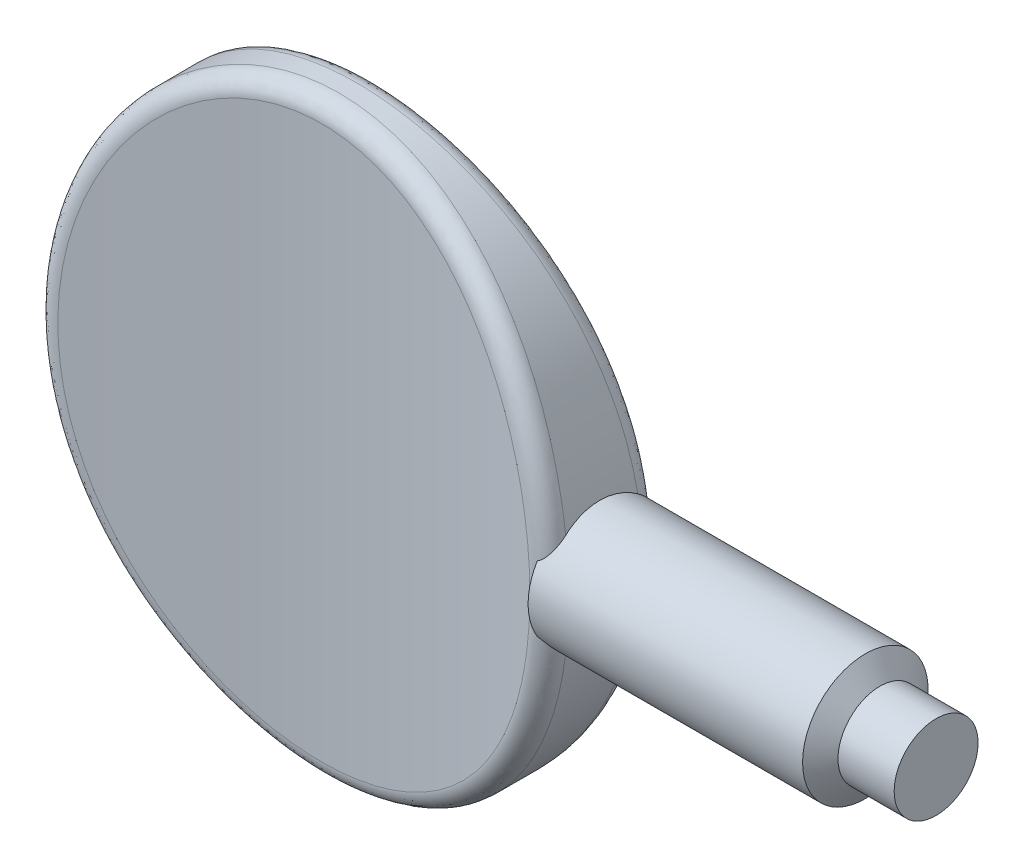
from build123d import *

# Parameters (mm, degrees)
SKETCH1_RX              = 11.303
SKETCH1_RY              = 9.906
EXTRUDE1_DEPTH          = 2.286
CUT_EXTRUDE1_DEPTH      = 16.202382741
CUT_EXTRUDE1_DEPTH_BACK = 16.202382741
SKETCH2_OUTSIDE_W       = 27.892
SKETCH2_OUTSIDE_H       = 12.652
FILLET3_R               = 0.677333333


with BuildPart() as part:
    # Sketch1 → Extrude1 (new, symmetric)
    with BuildSketch(Plane.XY):
        with Locations(Location((0, 0), (0, 0, -90))):
            Ellipse(SKETCH1_RX, SKETCH1_RY)
    extrude(amount=EXTRUDE1_DEPTH, both=True)

    # Sketch2 outside → Cut-Extrude1 (cut, two sides: drawn at the far end of the back side and taken through both)
    with BuildSketch(Plane(origin=(0, 0, 0), x_dir=(1, 0, 0), z_dir=(0, 1, 0)).offset(-CUT_EXTRUDE1_DEPTH_BACK)):
        Rectangle(SKETCH2_OUTSIDE_W, SKETCH2_OUTSIDE_H)
        with BuildLine():
            Line((-9.906, 2.286), (-9.906, -2.286))
            ThreePointArc((-9.906, -2.286), (0, -1.016), (9.906, -2.286))
            Line((9.906, -2.286), (9.906, 2.286))
            ThreePointArc((9.906, 2.286), (0, 1.016), (-9.906, 2.286))
        make_face(mode=Mode.SUBTRACT)
    extrude(amount=CUT_EXTRUDE1_DEPTH + CUT_EXTRUDE1_DEPTH_BACK, mode=Mode.SUBTRACT)

    # Fillet3
    fillet3_edges = [part.edges().sort_by_distance(p)[0] for p in [
        (-7.228513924, -7.728494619, 1.687044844),
        (3.75e-07, 11.303, -1.016),
    ]]
    fillet(fillet3_edges, radius=FILLET3_R)

    # Sketch3 → Revolve1 (revolve)
    with BuildSketch(Plane(origin=(0, 0, 0), x_dir=(1, 0, 0), z_dir=(0, 1, 0)), mode=Mode.PRIVATE) as revolve1_sk:
        with BuildLine():
            Line((22.606, 0), (22.606, 1.6129))
            Line((22.606, 1.6129), (20.447, 1.6129))
            Line((20.447, 1.6129), (19.886763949, 2.413))
            Line((19.886763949, 2.413), (13.208, 2.413))
            Line((13.208, 2.413), (9.336678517, 2.413))
            ThreePointArc((9.336678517, 2.413), (9.262571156, 2.199720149), (9.072182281, 2.078343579))
            Line((9.072182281, 2.078343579), (9.072182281, 0))
            Line((9.072182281, 0), (22.606, 0))
        make_face()
    revolve(revolve1_sk.sketch.rotate(Axis((0, 0, 0), (1, 0, 0)), 180), axis=Axis((0, 0, 0), (1, 0, 0)))


solid = part.part
